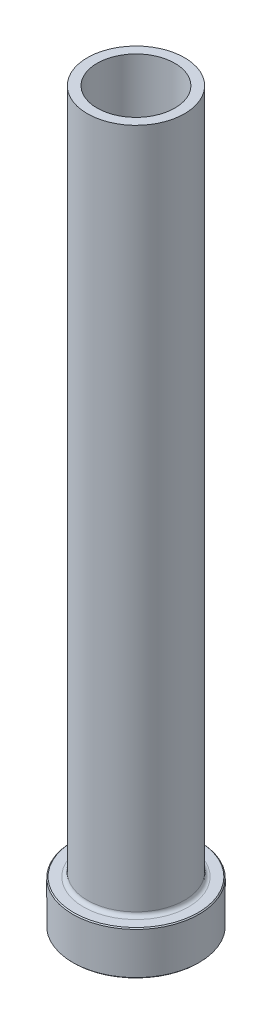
ISO-10303-21;
HEADER;
FILE_DESCRIPTION(('STEP AP214'),'2;1');
FILE_NAME('part.step','',(''),(''),'','','');
FILE_SCHEMA(('AUTOMOTIVE_DESIGN { 1 0 10303 214 1 1 1 1 }'));
ENDSEC;
DATA;
#1=APPLICATION_CONTEXT('core data for automotive mechanical design processes');
#2=APPLICATION_PROTOCOL_DEFINITION('international standard','automotive_design',2000,#1);
#3=PRODUCT_CONTEXT('',#1,'mechanical');
#4=PRODUCT('Part','Part','',(#3));
#5=PRODUCT_RELATED_PRODUCT_CATEGORY('part','',(#4));
#6=PRODUCT_DEFINITION_FORMATION('','',#4);
#7=PRODUCT_DEFINITION_CONTEXT('part definition',#1,'design');
#8=PRODUCT_DEFINITION('design','',#6,#7);
#9=PRODUCT_DEFINITION_SHAPE('','',#8);
#10=(LENGTH_UNIT() NAMED_UNIT(*) SI_UNIT(.MILLI.,.METRE.));
#11=(NAMED_UNIT(*) PLANE_ANGLE_UNIT() SI_UNIT($,.RADIAN.));
#12=(NAMED_UNIT(*) SI_UNIT($,.STERADIAN.) SOLID_ANGLE_UNIT());
#13=UNCERTAINTY_MEASURE_WITH_UNIT(LENGTH_MEASURE(1.E-05),#10,'distance_accuracy_value','');
#14=(GEOMETRIC_REPRESENTATION_CONTEXT(3) GLOBAL_UNCERTAINTY_ASSIGNED_CONTEXT((#13)) GLOBAL_UNIT_ASSIGNED_CONTEXT((#10,
#11,#12)) REPRESENTATION_CONTEXT('',''));
#15=CARTESIAN_POINT('',(0.,0.,0.));
#16=DIRECTION('',(0.,0.,1.));
#17=DIRECTION('',(1.,0.,0.));
#18=AXIS2_PLACEMENT_3D('',#15,#16,#17);
#19=CARTESIAN_POINT('',(0.,92.1876809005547,0.));
#20=DIRECTION('',(0.,1.,0.));
#21=DIRECTION('',(0.,0.,1.));
#22=AXIS2_PLACEMENT_3D('',#19,#20,#21);
#23=CYLINDRICAL_SURFACE('',#22,8.);
#24=CARTESIAN_POINT('',(0.,150.,0.));
#25=DIRECTION('',(0.,1.,0.));
#26=DIRECTION('',(0.,0.,1.));
#27=AXIS2_PLACEMENT_3D('',#24,#25,#26);
#28=CIRCLE('',#27,8.);
#29=CARTESIAN_POINT('',(0.,150.,8.));
#30=VERTEX_POINT('',#29);
#31=EDGE_CURVE('E62',#30,#30,#28,.T.);
#32=ORIENTED_EDGE('',*,*,#31,.T.);
#33=EDGE_LOOP('',(#32));
#34=FACE_BOUND('',#33,.T.);
#35=CARTESIAN_POINT('',(0.,95.,0.));
#36=DIRECTION('',(0.,1.,0.));
#37=DIRECTION('',(0.,0.,1.));
#38=AXIS2_PLACEMENT_3D('',#35,#36,#37);
#39=CIRCLE('',#38,8.);
#40=CARTESIAN_POINT('',(0.,95.,8.));
#41=VERTEX_POINT('',#40);
#42=EDGE_CURVE('E71',#41,#41,#39,.T.);
#43=ORIENTED_EDGE('',*,*,#42,.F.);
#44=EDGE_LOOP('',(#43));
#45=FACE_BOUND('',#44,.T.);
#46=ADVANCED_FACE('F30',(#34,#45),#23,.F.);
#47=CARTESIAN_POINT('',(-8.,150.,0.));
#48=DIRECTION('',(0.,1.,0.));
#49=DIRECTION('',(0.,0.,1.));
#50=AXIS2_PLACEMENT_3D('',#47,#48,#49);
#51=PLANE('',#50);
#52=CARTESIAN_POINT('',(0.,150.,0.));
#53=DIRECTION('',(0.,1.,0.));
#54=DIRECTION('',(0.,0.,1.));
#55=AXIS2_PLACEMENT_3D('',#52,#53,#54);
#56=CIRCLE('',#55,10.);
#57=CARTESIAN_POINT('',(0.,150.,10.));
#58=VERTEX_POINT('',#57);
#59=EDGE_CURVE('E65',#58,#58,#56,.T.);
#60=ORIENTED_EDGE('',*,*,#59,.T.);
#61=EDGE_LOOP('',(#60));
#62=FACE_BOUND('',#61,.T.);
#63=ORIENTED_EDGE('',*,*,#31,.F.);
#64=EDGE_LOOP('',(#63));
#65=FACE_BOUND('',#64,.T.);
#66=ADVANCED_FACE('F79',(#62,#65),#51,.T.);
#67=CARTESIAN_POINT('',(0.,92.1876809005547,0.));
#68=DIRECTION('',(0.,1.,0.));
#69=DIRECTION('',(0.,0.,1.));
#70=AXIS2_PLACEMENT_3D('',#67,#68,#69);
#71=CYLINDRICAL_SURFACE('',#70,10.);
#72=CARTESIAN_POINT('',(0.,9.8,0.));
#73=DIRECTION('',(0.,1.,0.));
#74=DIRECTION('',(0.,0.,1.));
#75=AXIS2_PLACEMENT_3D('',#72,#73,#74);
#76=CIRCLE('',#75,10.);
#77=CARTESIAN_POINT('',(0.,9.8,10.));
#78=VERTEX_POINT('',#77);
#79=EDGE_CURVE('E59',#78,#78,#76,.T.);
#80=ORIENTED_EDGE('',*,*,#79,.T.);
#81=EDGE_LOOP('',(#80));
#82=FACE_BOUND('',#81,.T.);
#83=ORIENTED_EDGE('',*,*,#59,.F.);
#84=EDGE_LOOP('',(#83));
#85=FACE_BOUND('',#84,.T.);
#86=ADVANCED_FACE('F85',(#82,#85),#71,.T.);
#87=CARTESIAN_POINT('',(-9.99999999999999,9.,0.));
#88=DIRECTION('',(0.,1.,0.));
#89=DIRECTION('',(0.,0.,1.));
#90=AXIS2_PLACEMENT_3D('',#87,#88,#89);
#91=PLANE('',#90);
#92=CARTESIAN_POINT('',(0.,9.,0.));
#93=DIRECTION('',(0.,1.,0.));
#94=DIRECTION('',(0.,0.,1.));
#95=AXIS2_PLACEMENT_3D('',#92,#93,#94);
#96=CIRCLE('',#95,12.8);
#97=CARTESIAN_POINT('',(0.,9.,12.8));
#98=VERTEX_POINT('',#97);
#99=EDGE_CURVE('E53',#98,#98,#96,.T.);
#100=ORIENTED_EDGE('',*,*,#99,.T.);
#101=EDGE_LOOP('',(#100));
#102=FACE_BOUND('',#101,.T.);
#103=CARTESIAN_POINT('',(0.,9.,0.));
#104=DIRECTION('',(0.,1.,0.));
#105=DIRECTION('',(0.,0.,1.));
#106=AXIS2_PLACEMENT_3D('',#103,#104,#105);
#107=CIRCLE('',#106,10.8);
#108=CARTESIAN_POINT('',(0.,9.,10.8));
#109=VERTEX_POINT('',#108);
#110=EDGE_CURVE('E56',#109,#109,#107,.F.);
#111=ORIENTED_EDGE('',*,*,#110,.T.);
#112=EDGE_LOOP('',(#111));
#113=FACE_BOUND('',#112,.T.);
#114=ADVANCED_FACE('F111',(#102,#113),#91,.T.);
#115=CARTESIAN_POINT('',(0.,92.1876809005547,0.));
#116=DIRECTION('',(0.,1.,0.));
#117=DIRECTION('',(0.,0.,1.));
#118=AXIS2_PLACEMENT_3D('',#115,#116,#117);
#119=CYLINDRICAL_SURFACE('',#118,13.);
#120=CARTESIAN_POINT('',(0.,8.79999999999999,0.));
#121=DIRECTION('',(0.,1.,0.));
#122=DIRECTION('',(0.,0.,1.));
#123=AXIS2_PLACEMENT_3D('',#120,#121,#122);
#124=CIRCLE('',#123,13.);
#125=CARTESIAN_POINT('',(0.,8.79999999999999,13.));
#126=VERTEX_POINT('',#125);
#127=EDGE_CURVE('E45',#126,#126,#124,.F.);
#128=ORIENTED_EDGE('',*,*,#127,.T.);
#129=EDGE_LOOP('',(#128));
#130=FACE_BOUND('',#129,.T.);
#131=CARTESIAN_POINT('',(0.,0.20000000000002,0.));
#132=DIRECTION('',(0.,-1.,0.));
#133=DIRECTION('',(0.,0.,-1.));
#134=AXIS2_PLACEMENT_3D('',#131,#132,#133);
#135=CIRCLE('',#134,13.);
#136=CARTESIAN_POINT('',(0.,0.20000000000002,-13.));
#137=VERTEX_POINT('',#136);
#138=EDGE_CURVE('E50',#137,#137,#135,.F.);
#139=ORIENTED_EDGE('',*,*,#138,.T.);
#140=EDGE_LOOP('',(#139));
#141=FACE_BOUND('',#140,.T.);
#142=ADVANCED_FACE('F108',(#130,#141),#119,.T.);
#143=CARTESIAN_POINT('',(-13.,0.,0.));
#144=DIRECTION('',(0.,-1.,0.));
#145=DIRECTION('',(0.,0.,-1.));
#146=AXIS2_PLACEMENT_3D('',#143,#144,#145);
#147=PLANE('',#146);
#148=CARTESIAN_POINT('',(0.,0.,0.));
#149=DIRECTION('',(0.,-1.,0.));
#150=DIRECTION('',(0.,0.,-1.));
#151=AXIS2_PLACEMENT_3D('',#148,#149,#150);
#152=CIRCLE('',#151,8.74999999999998);
#153=CARTESIAN_POINT('',(0.,0.,-8.74999999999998));
#154=VERTEX_POINT('',#153);
#155=EDGE_CURVE('E37',#154,#154,#152,.F.);
#156=ORIENTED_EDGE('',*,*,#155,.T.);
#157=EDGE_LOOP('',(#156));
#158=FACE_BOUND('',#157,.T.);
#159=CARTESIAN_POINT('',(0.,0.,0.));
#160=DIRECTION('',(0.,-1.,0.));
#161=DIRECTION('',(0.,0.,-1.));
#162=AXIS2_PLACEMENT_3D('',#159,#160,#161);
#163=CIRCLE('',#162,12.8);
#164=CARTESIAN_POINT('',(0.,0.,-12.8));
#165=VERTEX_POINT('',#164);
#166=EDGE_CURVE('E41',#165,#165,#163,.T.);
#167=ORIENTED_EDGE('',*,*,#166,.T.);
#168=EDGE_LOOP('',(#167));
#169=FACE_BOUND('',#168,.T.);
#170=ADVANCED_FACE('F110',(#158,#169),#147,.T.);
#171=CARTESIAN_POINT('',(0.,92.1876809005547,0.));
#172=DIRECTION('',(0.,1.,0.));
#173=DIRECTION('',(0.,0.,1.));
#174=AXIS2_PLACEMENT_3D('',#171,#172,#173);
#175=CYLINDRICAL_SURFACE('',#174,8.24999999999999);
#176=CARTESIAN_POINT('',(0.,0.5,0.));
#177=DIRECTION('',(0.,-1.,0.));
#178=DIRECTION('',(0.,0.,-1.));
#179=AXIS2_PLACEMENT_3D('',#176,#177,#178);
#180=CIRCLE('',#179,8.24999999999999);
#181=CARTESIAN_POINT('',(0.,0.5,-8.24999999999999));
#182=VERTEX_POINT('',#181);
#183=EDGE_CURVE('E10',#182,#182,#180,.T.);
#184=ORIENTED_EDGE('',*,*,#183,.T.);
#185=EDGE_LOOP('',(#184));
#186=FACE_BOUND('',#185,.T.);
#187=CARTESIAN_POINT('',(0.,83.,0.));
#188=DIRECTION('',(0.,1.,0.));
#189=DIRECTION('',(0.,0.,1.));
#190=AXIS2_PLACEMENT_3D('',#187,#188,#189);
#191=CIRCLE('',#190,8.25);
#192=CARTESIAN_POINT('',(0.,83.,8.25));
#193=VERTEX_POINT('',#192);
#194=EDGE_CURVE('E68',#193,#193,#191,.T.);
#195=ORIENTED_EDGE('',*,*,#194,.T.);
#196=EDGE_LOOP('',(#195));
#197=FACE_BOUND('',#196,.T.);
#198=ADVANCED_FACE('F118',(#186,#197),#175,.F.);
#199=CARTESIAN_POINT('',(0.,83.,0.));
#200=DIRECTION('',(0.,-1.,0.));
#201=DIRECTION('',(0.,0.,-1.));
#202=AXIS2_PLACEMENT_3D('',#199,#200,#201);
#203=CONICAL_SURFACE('',#202,8.25,0.0208303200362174);
#204=ORIENTED_EDGE('',*,*,#42,.T.);
#205=EDGE_LOOP('',(#204));
#206=FACE_BOUND('',#205,.T.);
#207=ORIENTED_EDGE('',*,*,#194,.F.);
#208=EDGE_LOOP('',(#207));
#209=FACE_BOUND('',#208,.T.);
#210=ADVANCED_FACE('F75',(#206,#209),#203,.F.);
#211=CARTESIAN_POINT('',(0.,9.8,0.));
#212=DIRECTION('',(0.,1.,0.));
#213=DIRECTION('',(0.,0.,1.));
#214=AXIS2_PLACEMENT_3D('',#211,#212,#213);
#215=TOROIDAL_SURFACE('',#214,10.8,0.8);
#216=ORIENTED_EDGE('',*,*,#110,.F.);
#217=EDGE_LOOP('',(#216));
#218=FACE_BOUND('',#217,.T.);
#219=ORIENTED_EDGE('',*,*,#79,.F.);
#220=EDGE_LOOP('',(#219));
#221=FACE_BOUND('',#220,.T.);
#222=ADVANCED_FACE('F90',(#218,#221),#215,.F.);
#223=CARTESIAN_POINT('',(0.,8.99999999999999,0.));
#224=DIRECTION('',(0.,-1.,0.));
#225=DIRECTION('',(0.,0.,-1.));
#226=AXIS2_PLACEMENT_3D('',#223,#224,#225);
#227=CONICAL_SURFACE('',#226,12.8,0.785398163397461);
#228=ORIENTED_EDGE('',*,*,#127,.F.);
#229=EDGE_LOOP('',(#228));
#230=FACE_BOUND('',#229,.T.);
#231=ORIENTED_EDGE('',*,*,#99,.F.);
#232=EDGE_LOOP('',(#231));
#233=FACE_BOUND('',#232,.T.);
#234=ADVANCED_FACE('F93',(#230,#233),#227,.T.);
#235=CARTESIAN_POINT('',(0.,0.20000000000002,0.));
#236=DIRECTION('',(0.,1.,0.));
#237=DIRECTION('',(0.,0.,1.));
#238=AXIS2_PLACEMENT_3D('',#235,#236,#237);
#239=CONICAL_SURFACE('',#238,13.,0.785398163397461);
#240=ORIENTED_EDGE('',*,*,#166,.F.);
#241=EDGE_LOOP('',(#240));
#242=FACE_BOUND('',#241,.T.);
#243=ORIENTED_EDGE('',*,*,#138,.F.);
#244=EDGE_LOOP('',(#243));
#245=FACE_BOUND('',#244,.T.);
#246=ADVANCED_FACE('F96',(#242,#245),#239,.T.);
#247=CARTESIAN_POINT('',(0.,0.,0.));
#248=DIRECTION('',(0.,-1.,0.));
#249=DIRECTION('',(0.,0.,-1.));
#250=AXIS2_PLACEMENT_3D('',#247,#248,#249);
#251=CONICAL_SURFACE('',#250,8.74999999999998,0.785398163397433);
#252=ORIENTED_EDGE('',*,*,#183,.F.);
#253=EDGE_LOOP('',(#252));
#254=FACE_BOUND('',#253,.T.);
#255=ORIENTED_EDGE('',*,*,#155,.F.);
#256=EDGE_LOOP('',(#255));
#257=FACE_BOUND('',#256,.T.);
#258=ADVANCED_FACE('F32',(#254,#257),#251,.F.);
#259=CLOSED_SHELL('',(#46,#66,#86,#114,#142,#170,#198,#210,#222,#234,#246,#258));
#260=MANIFOLD_SOLID_BREP('B2',#259);
#261=ADVANCED_BREP_SHAPE_REPRESENTATION('',(#18,#260),#14);
#262=SHAPE_DEFINITION_REPRESENTATION(#9,#261);
ENDSEC;
END-ISO-10303-21;
